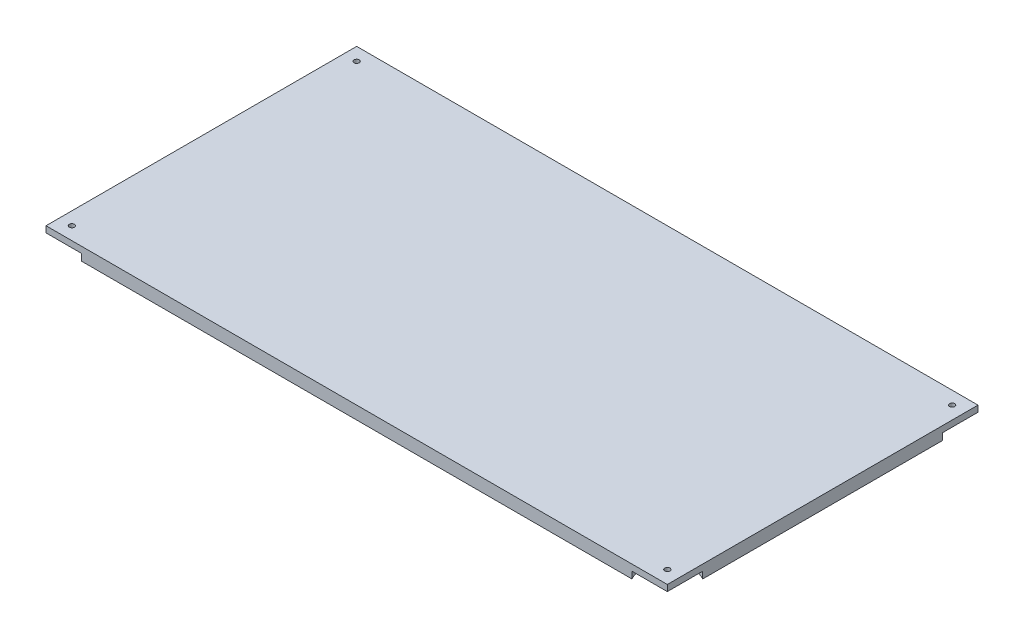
from build123d import *

# Parameters (mm, degrees)
SKETCH1_W                        = 304.8
SKETCH1_H                        = 152.4
BOSS_EXTRUDE1_DEPTH              = 6.35
F_97_0_0059_DIAMETER_HOLE1_D     = 2.54
F_97_0_0059_DIAMETER_HOLE2_D     = 25.4
F_97_0_0059_DIAMETER_HOLE2_DEPTH = 3.302
MIRROR4_COPY_1_D                 = 2.54
MIRROR4_COPY_2_D                 = 25.4
MIRROR4_COPY_2_DEPTH             = 3.302


with BuildPart() as part:
    # Sketch1 → Boss-Extrude1 (new body)
    with BuildSketch(Plane(origin=(0, 0, 0), x_dir=(1, 0, 0), z_dir=(0, 1, 0))):
        with Locations((103.935348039, -39.411650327)):
            Rectangle(SKETCH1_W, SKETCH1_H)
    extrude(amount=BOSS_EXTRUDE1_DEPTH)

    # 97 _0.0059_ Diameter Hole1 (through all)
    with Locations(Plane.XZ):
        with Locations((249.985348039, 109.261650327)):
            f_97_0_0059_diameter_hole1 = Hole(F_97_0_0059_DIAMETER_HOLE1_D / 2)

    # 97 _0.0059_ Diameter Hole2
    with Locations(Plane.XZ):
        with Locations((249.985348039, 109.261650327)):
            f_97_0_0059_diameter_hole2 = Hole(F_97_0_0059_DIAMETER_HOLE2_D / 2, depth=F_97_0_0059_DIAMETER_HOLE2_DEPTH)

    # Mirror3: 97 _0.0059_ Diameter Hole1, 97 _0.0059_ Diameter Hole2 across plane
    add(f_97_0_0059_diameter_hole1.mirror(Plane.ZY.offset(-103.935348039)), mode=Mode.SUBTRACT)
    add(f_97_0_0059_diameter_hole2.mirror(Plane.ZY.offset(-103.935348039)), mode=Mode.SUBTRACT)

    # Mirror4: 97 _0.0059_ Diameter Hole1, 97 _0.0059_ Diameter Hole2 across plane
    add(f_97_0_0059_diameter_hole1.mirror(Plane.XY.offset(39.411650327)), mode=Mode.SUBTRACT)
    add(f_97_0_0059_diameter_hole2.mirror(Plane.XY.offset(39.411650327)), mode=Mode.SUBTRACT)

    # Mirror4 copy 1 (through all)
    with Locations(Plane(origin=(207.870696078, 0, 78.823300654), x_dir=(-1, 0, 0), z_dir=(0, -1, 0))):
        with Locations((249.985348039, 109.261650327)):
            Hole(MIRROR4_COPY_1_D / 2)

    # Mirror4 copy 2
    with Locations(Plane(origin=(207.870696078, 0, 78.823300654), x_dir=(-1, 0, 0), z_dir=(0, -1, 0))):
        with Locations((249.985348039, 109.261650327)):
            Hole(MIRROR4_COPY_2_D / 2, depth=MIRROR4_COPY_2_DEPTH)


solid = part.part
